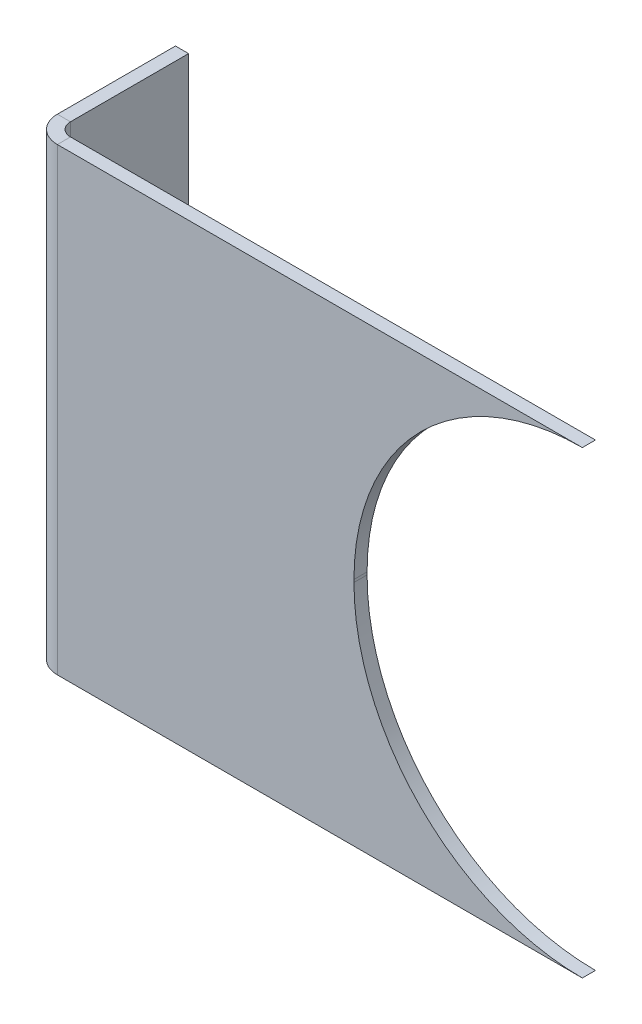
ISO-10303-21;
HEADER;
FILE_DESCRIPTION(('STEP AP214'),'2;1');
FILE_NAME('part.step','',(''),(''),'','','');
FILE_SCHEMA(('AUTOMOTIVE_DESIGN { 1 0 10303 214 1 1 1 1 }'));
ENDSEC;
DATA;
#1=APPLICATION_CONTEXT('core data for automotive mechanical design processes');
#2=APPLICATION_PROTOCOL_DEFINITION('international standard','automotive_design',2000,#1);
#3=PRODUCT_CONTEXT('',#1,'mechanical');
#4=PRODUCT('Part','Part','',(#3));
#5=PRODUCT_RELATED_PRODUCT_CATEGORY('part','',(#4));
#6=PRODUCT_DEFINITION_FORMATION('','',#4);
#7=PRODUCT_DEFINITION_CONTEXT('part definition',#1,'design');
#8=PRODUCT_DEFINITION('design','',#6,#7);
#9=PRODUCT_DEFINITION_SHAPE('','',#8);
#10=(LENGTH_UNIT() NAMED_UNIT(*) SI_UNIT(.MILLI.,.METRE.));
#11=(NAMED_UNIT(*) PLANE_ANGLE_UNIT() SI_UNIT($,.RADIAN.));
#12=(NAMED_UNIT(*) SI_UNIT($,.STERADIAN.) SOLID_ANGLE_UNIT());
#13=UNCERTAINTY_MEASURE_WITH_UNIT(LENGTH_MEASURE(1.E-05),#10,'distance_accuracy_value','');
#14=(GEOMETRIC_REPRESENTATION_CONTEXT(3) GLOBAL_UNCERTAINTY_ASSIGNED_CONTEXT((#13)) GLOBAL_UNIT_ASSIGNED_CONTEXT((#10,
#11,#12)) REPRESENTATION_CONTEXT('',''));
#15=CARTESIAN_POINT('',(0.,0.,0.));
#16=DIRECTION('',(0.,0.,1.));
#17=DIRECTION('',(1.,0.,0.));
#18=AXIS2_PLACEMENT_3D('',#15,#16,#17);
#19=CARTESIAN_POINT('',(-54.6000000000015,-65.0500000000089,1.));
#20=DIRECTION('',(0.,1.,0.));
#21=DIRECTION('',(-1.,0.,0.));
#22=AXIS2_PLACEMENT_3D('',#19,#20,#21);
#23=PLANE('',#22);
#24=DIRECTION('',(0.,0.,1.));
#25=VECTOR('',#24,1.);
#26=CARTESIAN_POINT('',(-94.5999999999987,-65.0500000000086,0.));
#27=LINE('',#26,#25);
#28=CARTESIAN_POINT('',(-94.5999999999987,-65.0500000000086,0.));
#29=VERTEX_POINT('',#28);
#30=CARTESIAN_POINT('',(-94.5999999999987,-65.0500000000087,1.));
#31=VERTEX_POINT('',#30);
#32=EDGE_CURVE('E200',#29,#31,#27,.T.);
#33=ORIENTED_EDGE('',*,*,#32,.F.);
#34=DIRECTION('',(1.,0.,0.));
#35=VECTOR('',#34,1.);
#36=CARTESIAN_POINT('',(-54.6000000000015,-65.0500000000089,0.));
#37=LINE('',#36,#35);
#38=CARTESIAN_POINT('',(-54.6000000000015,-65.0500000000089,0.));
#39=VERTEX_POINT('',#38);
#40=EDGE_CURVE('E202',#29,#39,#37,.T.);
#41=ORIENTED_EDGE('',*,*,#40,.T.);
#42=DIRECTION('',(0.,0.,-1.));
#43=VECTOR('',#42,1.);
#44=CARTESIAN_POINT('',(-54.6000000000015,-65.0500000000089,1.));
#45=LINE('',#44,#43);
#46=CARTESIAN_POINT('',(-54.6000000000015,-65.0500000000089,1.));
#47=VERTEX_POINT('',#46);
#48=EDGE_CURVE('E13',#47,#39,#45,.T.);
#49=ORIENTED_EDGE('',*,*,#48,.F.);
#50=DIRECTION('',(1.,0.,0.));
#51=VECTOR('',#50,1.);
#52=CARTESIAN_POINT('',(-54.6000000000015,-65.0500000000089,1.));
#53=LINE('',#52,#51);
#54=EDGE_CURVE('E108',#31,#47,#53,.T.);
#55=ORIENTED_EDGE('',*,*,#54,.F.);
#56=EDGE_LOOP('',(#33,#41,#49,#55));
#57=FACE_BOUND('',#56,.T.);
#58=ADVANCED_FACE('F57',(#57),#23,.F.);
#59=CARTESIAN_POINT('',(-54.6000000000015,-30.0500000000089,1.));
#60=DIRECTION('',(0.,-1.,0.));
#61=DIRECTION('',(1.,0.,0.));
#62=AXIS2_PLACEMENT_3D('',#59,#60,#61);
#63=PLANE('',#62);
#64=DIRECTION('',(0.,0.,1.));
#65=VECTOR('',#64,1.);
#66=CARTESIAN_POINT('',(-94.5999999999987,-30.0500000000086,0.));
#67=LINE('',#66,#65);
#68=CARTESIAN_POINT('',(-94.5999999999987,-30.0500000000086,0.));
#69=VERTEX_POINT('',#68);
#70=CARTESIAN_POINT('',(-94.5999999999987,-30.0500000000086,0.999999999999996));
#71=VERTEX_POINT('',#70);
#72=EDGE_CURVE('E193',#69,#71,#67,.T.);
#73=ORIENTED_EDGE('',*,*,#72,.T.);
#74=DIRECTION('',(-1.,0.,0.));
#75=VECTOR('',#74,1.);
#76=CARTESIAN_POINT('',(-54.6000000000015,-30.0500000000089,1.));
#77=LINE('',#76,#75);
#78=CARTESIAN_POINT('',(-54.6000000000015,-30.0500000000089,1.));
#79=VERTEX_POINT('',#78);
#80=EDGE_CURVE('E211',#79,#71,#77,.T.);
#81=ORIENTED_EDGE('',*,*,#80,.F.);
#82=DIRECTION('',(0.,0.,-1.));
#83=VECTOR('',#82,1.);
#84=CARTESIAN_POINT('',(-54.6000000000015,-30.0500000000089,1.));
#85=LINE('',#84,#83);
#86=CARTESIAN_POINT('',(-54.6000000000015,-30.0500000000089,0.));
#87=VERTEX_POINT('',#86);
#88=EDGE_CURVE('E213',#79,#87,#85,.T.);
#89=ORIENTED_EDGE('',*,*,#88,.T.);
#90=DIRECTION('',(-1.,0.,0.));
#91=VECTOR('',#90,1.);
#92=CARTESIAN_POINT('',(-54.6000000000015,-30.0500000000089,0.));
#93=LINE('',#92,#91);
#94=EDGE_CURVE('E206',#87,#69,#93,.T.);
#95=ORIENTED_EDGE('',*,*,#94,.T.);
#96=EDGE_LOOP('',(#73,#81,#89,#95));
#97=FACE_BOUND('',#96,.T.);
#98=ADVANCED_FACE('F240',(#97),#63,.F.);
#99=CARTESIAN_POINT('',(-54.6000000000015,-47.6500000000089,1.));
#100=DIRECTION('',(0.,0.,1.));
#101=DIRECTION('',(1.,0.,0.));
#102=AXIS2_PLACEMENT_3D('',#99,#100,#101);
#103=PLANE('',#102);
#104=ORIENTED_EDGE('',*,*,#80,.T.);
#105=DIRECTION('',(0.,1.,0.));
#106=VECTOR('',#105,1.);
#107=CARTESIAN_POINT('',(-94.5999999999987,-30.0500000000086,0.999999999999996));
#108=LINE('',#107,#106);
#109=EDGE_CURVE('E146',#71,#31,#108,.F.);
#110=ORIENTED_EDGE('',*,*,#109,.T.);
#111=ORIENTED_EDGE('',*,*,#54,.T.);
#112=CARTESIAN_POINT('',(-54.6000000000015,-47.6500000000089,1.));
#113=DIRECTION('',(0.,0.,-1.));
#114=DIRECTION('',(1.,0.,0.));
#115=AXIS2_PLACEMENT_3D('',#112,#113,#114);
#116=CIRCLE('',#115,17.4);
#117=CARTESIAN_POINT('',(-72.0000000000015,-47.6500000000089,1.));
#118=VERTEX_POINT('',#117);
#119=EDGE_CURVE('E205',#47,#118,#116,.T.);
#120=ORIENTED_EDGE('',*,*,#119,.T.);
#121=DIRECTION('',(0.,1.,0.));
#122=VECTOR('',#121,1.);
#123=CARTESIAN_POINT('',(-72.0000000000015,-47.4500000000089,1.));
#124=LINE('',#123,#122);
#125=CARTESIAN_POINT('',(-72.0000000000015,-47.4500000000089,1.));
#126=VERTEX_POINT('',#125);
#127=EDGE_CURVE('E208',#118,#126,#124,.T.);
#128=ORIENTED_EDGE('',*,*,#127,.T.);
#129=CARTESIAN_POINT('',(-54.6000000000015,-47.4500000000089,1.));
#130=DIRECTION('',(0.,0.,-1.));
#131=DIRECTION('',(1.,0.,0.));
#132=AXIS2_PLACEMENT_3D('',#129,#130,#131);
#133=CIRCLE('',#132,17.4);
#134=EDGE_CURVE('E80',#126,#79,#133,.T.);
#135=ORIENTED_EDGE('',*,*,#134,.T.);
#136=EDGE_LOOP('',(#104,#110,#111,#120,#128,#135));
#137=FACE_BOUND('',#136,.T.);
#138=ADVANCED_FACE('F260',(#137),#103,.T.);
#139=CARTESIAN_POINT('',(-54.6000000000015,-47.6500000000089,0.));
#140=DIRECTION('',(0.,0.,1.));
#141=DIRECTION('',(1.,0.,0.));
#142=AXIS2_PLACEMENT_3D('',#139,#140,#141);
#143=PLANE('',#142);
#144=DIRECTION('',(0.,1.,0.));
#145=VECTOR('',#144,1.);
#146=CARTESIAN_POINT('',(-94.5999999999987,-30.0500000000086,0.));
#147=LINE('',#146,#145);
#148=EDGE_CURVE('E197',#69,#29,#147,.F.);
#149=ORIENTED_EDGE('',*,*,#148,.F.);
#150=ORIENTED_EDGE('',*,*,#94,.F.);
#151=CARTESIAN_POINT('',(-54.6000000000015,-47.4500000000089,0.));
#152=DIRECTION('',(0.,0.,-1.));
#153=DIRECTION('',(1.,0.,0.));
#154=AXIS2_PLACEMENT_3D('',#151,#152,#153);
#155=CIRCLE('',#154,17.4);
#156=CARTESIAN_POINT('',(-72.0000000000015,-47.4500000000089,0.));
#157=VERTEX_POINT('',#156);
#158=EDGE_CURVE('E101',#157,#87,#155,.T.);
#159=ORIENTED_EDGE('',*,*,#158,.F.);
#160=DIRECTION('',(0.,1.,0.));
#161=VECTOR('',#160,1.);
#162=CARTESIAN_POINT('',(-72.0000000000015,-47.4500000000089,0.));
#163=LINE('',#162,#161);
#164=CARTESIAN_POINT('',(-72.0000000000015,-47.6500000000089,0.));
#165=VERTEX_POINT('',#164);
#166=EDGE_CURVE('E217',#165,#157,#163,.T.);
#167=ORIENTED_EDGE('',*,*,#166,.F.);
#168=CARTESIAN_POINT('',(-54.6000000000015,-47.6500000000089,0.));
#169=DIRECTION('',(0.,0.,-1.));
#170=DIRECTION('',(1.,0.,0.));
#171=AXIS2_PLACEMENT_3D('',#168,#169,#170);
#172=CIRCLE('',#171,17.4);
#173=EDGE_CURVE('E215',#39,#165,#172,.T.);
#174=ORIENTED_EDGE('',*,*,#173,.F.);
#175=ORIENTED_EDGE('',*,*,#40,.F.);
#176=EDGE_LOOP('',(#149,#150,#159,#167,#174,#175));
#177=FACE_BOUND('',#176,.T.);
#178=ADVANCED_FACE('F236',(#177),#143,.F.);
#179=CARTESIAN_POINT('',(-54.6000000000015,-47.6500000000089,1.));
#180=DIRECTION('',(0.,0.,-1.));
#181=DIRECTION('',(-1.,0.,0.));
#182=AXIS2_PLACEMENT_3D('',#179,#180,#181);
#183=CYLINDRICAL_SURFACE('',#182,17.4);
#184=ORIENTED_EDGE('',*,*,#173,.T.);
#185=DIRECTION('',(0.,0.,-1.));
#186=VECTOR('',#185,1.);
#187=CARTESIAN_POINT('',(-72.0000000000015,-47.6500000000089,1.));
#188=LINE('',#187,#186);
#189=EDGE_CURVE('E64',#118,#165,#188,.T.);
#190=ORIENTED_EDGE('',*,*,#189,.F.);
#191=ORIENTED_EDGE('',*,*,#119,.F.);
#192=ORIENTED_EDGE('',*,*,#48,.T.);
#193=EDGE_LOOP('',(#184,#190,#191,#192));
#194=FACE_BOUND('',#193,.T.);
#195=ADVANCED_FACE('F252',(#194),#183,.F.);
#196=CARTESIAN_POINT('',(-72.0000000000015,-47.4500000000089,1.));
#197=DIRECTION('',(-1.,0.,0.));
#198=DIRECTION('',(0.,0.,1.));
#199=AXIS2_PLACEMENT_3D('',#196,#197,#198);
#200=PLANE('',#199);
#201=ORIENTED_EDGE('',*,*,#166,.T.);
#202=DIRECTION('',(0.,0.,-1.));
#203=VECTOR('',#202,1.);
#204=CARTESIAN_POINT('',(-72.0000000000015,-47.4500000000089,1.));
#205=LINE('',#204,#203);
#206=EDGE_CURVE('E223',#126,#157,#205,.T.);
#207=ORIENTED_EDGE('',*,*,#206,.F.);
#208=ORIENTED_EDGE('',*,*,#127,.F.);
#209=ORIENTED_EDGE('',*,*,#189,.T.);
#210=EDGE_LOOP('',(#201,#207,#208,#209));
#211=FACE_BOUND('',#210,.T.);
#212=ADVANCED_FACE('F229',(#211),#200,.F.);
#213=CARTESIAN_POINT('',(-54.6000000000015,-47.4500000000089,1.));
#214=DIRECTION('',(0.,0.,-1.));
#215=DIRECTION('',(-1.,0.,0.));
#216=AXIS2_PLACEMENT_3D('',#213,#214,#215);
#217=CYLINDRICAL_SURFACE('',#216,17.4);
#218=ORIENTED_EDGE('',*,*,#158,.T.);
#219=ORIENTED_EDGE('',*,*,#88,.F.);
#220=ORIENTED_EDGE('',*,*,#134,.F.);
#221=ORIENTED_EDGE('',*,*,#206,.T.);
#222=EDGE_LOOP('',(#218,#219,#220,#221));
#223=FACE_BOUND('',#222,.T.);
#224=ADVANCED_FACE('F242',(#223),#217,.F.);
#225=CARTESIAN_POINT('',(-94.5999999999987,-65.0500000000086,-1.00000000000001));
#226=DIRECTION('',(0.,-1.,0.));
#227=DIRECTION('',(0.,0.,-1.));
#228=AXIS2_PLACEMENT_3D('',#225,#226,#227);
#229=PLANE('',#228);
#230=DIRECTION('',(1.,0.,0.));
#231=VECTOR('',#230,1.);
#232=CARTESIAN_POINT('',(-96.5999999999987,-65.0500000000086,-0.999999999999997));
#233=LINE('',#232,#231);
#234=CARTESIAN_POINT('',(-95.5999999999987,-65.0500000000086,-1.));
#235=VERTEX_POINT('',#234);
#236=CARTESIAN_POINT('',(-96.5999999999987,-65.0500000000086,-0.999999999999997));
#237=VERTEX_POINT('',#236);
#238=EDGE_CURVE('E189',#235,#237,#233,.F.);
#239=ORIENTED_EDGE('',*,*,#238,.F.);
#240=CARTESIAN_POINT('',(-94.5999999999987,-65.0500000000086,-1.00000000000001));
#241=DIRECTION('',(0.,1.,0.));
#242=DIRECTION('',(0.,0.,1.));
#243=AXIS2_PLACEMENT_3D('',#240,#241,#242);
#244=CIRCLE('',#243,1.);
#245=EDGE_CURVE('E149',#29,#235,#244,.F.);
#246=ORIENTED_EDGE('',*,*,#245,.F.);
#247=ORIENTED_EDGE('',*,*,#32,.T.);
#248=CARTESIAN_POINT('',(-94.5999999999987,-65.0500000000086,-1.00000000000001));
#249=DIRECTION('',(0.,1.,0.));
#250=DIRECTION('',(0.,0.,1.));
#251=AXIS2_PLACEMENT_3D('',#248,#249,#250);
#252=CIRCLE('',#251,2.);
#253=EDGE_CURVE('E71',#31,#237,#252,.F.);
#254=ORIENTED_EDGE('',*,*,#253,.T.);
#255=EDGE_LOOP('',(#239,#246,#247,#254));
#256=FACE_BOUND('',#255,.T.);
#257=ADVANCED_FACE('F244',(#256),#229,.T.);
#258=CARTESIAN_POINT('',(-94.5999999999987,-30.0500000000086,-1.00000000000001));
#259=DIRECTION('',(0.,-1.,0.));
#260=DIRECTION('',(0.,0.,-1.));
#261=AXIS2_PLACEMENT_3D('',#258,#259,#260);
#262=PLANE('',#261);
#263=CARTESIAN_POINT('',(-94.5999999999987,-30.0500000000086,-1.00000000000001));
#264=DIRECTION('',(0.,1.,0.));
#265=DIRECTION('',(0.,0.,1.));
#266=AXIS2_PLACEMENT_3D('',#263,#264,#265);
#267=CIRCLE('',#266,1.);
#268=CARTESIAN_POINT('',(-95.5999999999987,-30.0500000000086,-1.));
#269=VERTEX_POINT('',#268);
#270=EDGE_CURVE('E156',#269,#69,#267,.T.);
#271=ORIENTED_EDGE('',*,*,#270,.F.);
#272=DIRECTION('',(1.,0.,0.));
#273=VECTOR('',#272,1.);
#274=CARTESIAN_POINT('',(-95.5999999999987,-30.0500000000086,-1.));
#275=LINE('',#274,#273);
#276=CARTESIAN_POINT('',(-96.5999999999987,-30.0500000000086,-0.999999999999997));
#277=VERTEX_POINT('',#276);
#278=EDGE_CURVE('E153',#269,#277,#275,.F.);
#279=ORIENTED_EDGE('',*,*,#278,.T.);
#280=CARTESIAN_POINT('',(-94.5999999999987,-30.0500000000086,-1.00000000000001));
#281=DIRECTION('',(0.,1.,0.));
#282=DIRECTION('',(0.,0.,1.));
#283=AXIS2_PLACEMENT_3D('',#280,#281,#282);
#284=CIRCLE('',#283,2.);
#285=EDGE_CURVE('E141',#277,#71,#284,.T.);
#286=ORIENTED_EDGE('',*,*,#285,.T.);
#287=ORIENTED_EDGE('',*,*,#72,.F.);
#288=EDGE_LOOP('',(#271,#279,#286,#287));
#289=FACE_BOUND('',#288,.T.);
#290=ADVANCED_FACE('F154',(#289),#262,.F.);
#291=CARTESIAN_POINT('',(-94.5999999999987,-30.0500000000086,-1.00000000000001));
#292=DIRECTION('',(0.,1.,0.));
#293=DIRECTION('',(-1.,0.,0.));
#294=AXIS2_PLACEMENT_3D('',#291,#292,#293);
#295=CYLINDRICAL_SURFACE('',#294,2.);
#296=ORIENTED_EDGE('',*,*,#109,.F.);
#297=ORIENTED_EDGE('',*,*,#285,.F.);
#298=DIRECTION('',(0.,1.,0.));
#299=VECTOR('',#298,1.);
#300=CARTESIAN_POINT('',(-96.5999999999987,0.,-0.999999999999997));
#301=LINE('',#300,#299);
#302=EDGE_CURVE('E145',#237,#277,#301,.T.);
#303=ORIENTED_EDGE('',*,*,#302,.F.);
#304=ORIENTED_EDGE('',*,*,#253,.F.);
#305=EDGE_LOOP('',(#296,#297,#303,#304));
#306=FACE_BOUND('',#305,.T.);
#307=ADVANCED_FACE('F143',(#306),#295,.T.);
#308=CARTESIAN_POINT('',(-94.5999999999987,-30.0500000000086,-1.00000000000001));
#309=DIRECTION('',(0.,1.,0.));
#310=DIRECTION('',(-1.,0.,0.));
#311=AXIS2_PLACEMENT_3D('',#308,#309,#310);
#312=CYLINDRICAL_SURFACE('',#311,1.);
#313=ORIENTED_EDGE('',*,*,#148,.T.);
#314=ORIENTED_EDGE('',*,*,#245,.T.);
#315=DIRECTION('',(0.,-1.,0.));
#316=VECTOR('',#315,1.);
#317=CARTESIAN_POINT('',(-95.5999999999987,-65.0500000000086,-1.));
#318=LINE('',#317,#316);
#319=EDGE_CURVE('E160',#235,#269,#318,.F.);
#320=ORIENTED_EDGE('',*,*,#319,.T.);
#321=ORIENTED_EDGE('',*,*,#270,.T.);
#322=EDGE_LOOP('',(#313,#314,#320,#321));
#323=FACE_BOUND('',#322,.T.);
#324=ADVANCED_FACE('F272',(#323),#312,.F.);
#325=CARTESIAN_POINT('',(-96.5999999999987,-65.0500000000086,-10.));
#326=DIRECTION('',(0.,1.,0.));
#327=DIRECTION('',(0.,0.,1.));
#328=AXIS2_PLACEMENT_3D('',#325,#326,#327);
#329=PLANE('',#328);
#330=ORIENTED_EDGE('',*,*,#238,.T.);
#331=DIRECTION('',(0.,0.,-1.));
#332=VECTOR('',#331,1.);
#333=CARTESIAN_POINT('',(-96.5999999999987,-65.0500000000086,3.15394762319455E-13));
#334=LINE('',#333,#332);
#335=CARTESIAN_POINT('',(-96.5999999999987,-65.0500000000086,-10.));
#336=VERTEX_POINT('',#335);
#337=EDGE_CURVE('E168',#336,#237,#334,.F.);
#338=ORIENTED_EDGE('',*,*,#337,.F.);
#339=DIRECTION('',(1.,0.,0.));
#340=VECTOR('',#339,1.);
#341=CARTESIAN_POINT('',(-96.5999999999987,-65.0500000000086,-10.));
#342=LINE('',#341,#340);
#343=CARTESIAN_POINT('',(-95.5999999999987,-65.0500000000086,-10.));
#344=VERTEX_POINT('',#343);
#345=EDGE_CURVE('E177',#336,#344,#342,.T.);
#346=ORIENTED_EDGE('',*,*,#345,.T.);
#347=DIRECTION('',(0.,0.,1.));
#348=VECTOR('',#347,1.);
#349=CARTESIAN_POINT('',(-95.5999999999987,-65.0500000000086,-10.));
#350=LINE('',#349,#348);
#351=EDGE_CURVE('E169',#344,#235,#350,.T.);
#352=ORIENTED_EDGE('',*,*,#351,.T.);
#353=EDGE_LOOP('',(#330,#338,#346,#352));
#354=FACE_BOUND('',#353,.T.);
#355=ADVANCED_FACE('F275',(#354),#329,.F.);
#356=CARTESIAN_POINT('',(-96.5999999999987,-30.0500000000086,0.));
#357=DIRECTION('',(0.,-1.,0.));
#358=DIRECTION('',(0.,0.,-1.));
#359=AXIS2_PLACEMENT_3D('',#356,#357,#358);
#360=PLANE('',#359);
#361=ORIENTED_EDGE('',*,*,#278,.F.);
#362=DIRECTION('',(0.,0.,-1.));
#363=VECTOR('',#362,1.);
#364=CARTESIAN_POINT('',(-95.5999999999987,-30.0500000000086,0.));
#365=LINE('',#364,#363);
#366=CARTESIAN_POINT('',(-95.5999999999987,-30.0500000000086,-10.));
#367=VERTEX_POINT('',#366);
#368=EDGE_CURVE('E184',#269,#367,#365,.T.);
#369=ORIENTED_EDGE('',*,*,#368,.T.);
#370=DIRECTION('',(1.,0.,0.));
#371=VECTOR('',#370,1.);
#372=CARTESIAN_POINT('',(-96.5999999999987,-30.0500000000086,-10.));
#373=LINE('',#372,#371);
#374=CARTESIAN_POINT('',(-96.5999999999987,-30.0500000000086,-10.));
#375=VERTEX_POINT('',#374);
#376=EDGE_CURVE('E173',#375,#367,#373,.T.);
#377=ORIENTED_EDGE('',*,*,#376,.F.);
#378=DIRECTION('',(0.,0.,1.));
#379=VECTOR('',#378,1.);
#380=CARTESIAN_POINT('',(-96.5999999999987,-30.0500000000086,3.95244083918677E-13));
#381=LINE('',#380,#379);
#382=EDGE_CURVE('E165',#277,#375,#381,.F.);
#383=ORIENTED_EDGE('',*,*,#382,.F.);
#384=EDGE_LOOP('',(#361,#369,#377,#383));
#385=FACE_BOUND('',#384,.T.);
#386=ADVANCED_FACE('F171',(#385),#360,.F.);
#387=CARTESIAN_POINT('',(-96.5999999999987,0.,4.056697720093E-13));
#388=DIRECTION('',(-1.,0.,0.));
#389=DIRECTION('',(0.,0.,1.));
#390=AXIS2_PLACEMENT_3D('',#387,#388,#389);
#391=PLANE('',#390);
#392=ORIENTED_EDGE('',*,*,#337,.T.);
#393=ORIENTED_EDGE('',*,*,#302,.T.);
#394=ORIENTED_EDGE('',*,*,#382,.T.);
#395=DIRECTION('',(0.,1.,0.));
#396=VECTOR('',#395,1.);
#397=CARTESIAN_POINT('',(-96.5999999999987,0.,-10.));
#398=LINE('',#397,#396);
#399=EDGE_CURVE('E175',#375,#336,#398,.F.);
#400=ORIENTED_EDGE('',*,*,#399,.T.);
#401=EDGE_LOOP('',(#392,#393,#394,#400));
#402=FACE_BOUND('',#401,.T.);
#403=ADVANCED_FACE('F164',(#402),#391,.T.);
#404=CARTESIAN_POINT('',(-95.5999999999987,0.,4.02178290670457E-13));
#405=DIRECTION('',(-1.,0.,0.));
#406=DIRECTION('',(0.,0.,1.));
#407=AXIS2_PLACEMENT_3D('',#404,#405,#406);
#408=PLANE('',#407);
#409=ORIENTED_EDGE('',*,*,#319,.F.);
#410=ORIENTED_EDGE('',*,*,#351,.F.);
#411=DIRECTION('',(0.,-1.,0.));
#412=VECTOR('',#411,1.);
#413=CARTESIAN_POINT('',(-95.5999999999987,-30.0500000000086,-10.));
#414=LINE('',#413,#412);
#415=EDGE_CURVE('E179',#367,#344,#414,.T.);
#416=ORIENTED_EDGE('',*,*,#415,.F.);
#417=ORIENTED_EDGE('',*,*,#368,.F.);
#418=EDGE_LOOP('',(#409,#410,#416,#417));
#419=FACE_BOUND('',#418,.T.);
#420=ADVANCED_FACE('F287',(#419),#408,.F.);
#421=CARTESIAN_POINT('',(-96.5999999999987,-30.0500000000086,-10.));
#422=DIRECTION('',(0.,0.,1.));
#423=DIRECTION('',(1.,0.,0.));
#424=AXIS2_PLACEMENT_3D('',#421,#422,#423);
#425=PLANE('',#424);
#426=ORIENTED_EDGE('',*,*,#415,.T.);
#427=ORIENTED_EDGE('',*,*,#345,.F.);
#428=ORIENTED_EDGE('',*,*,#399,.F.);
#429=ORIENTED_EDGE('',*,*,#376,.T.);
#430=EDGE_LOOP('',(#426,#427,#428,#429));
#431=FACE_BOUND('',#430,.T.);
#432=ADVANCED_FACE('F284',(#431),#425,.F.);
#433=CLOSED_SHELL('',(#58,#98,#138,#178,#195,#212,#224,#257,#290,#307,#324,#355,#386,#403,#420,#432));
#434=MANIFOLD_SOLID_BREP('B2',#433);
#435=ADVANCED_BREP_SHAPE_REPRESENTATION('',(#18,#434),#14);
#436=SHAPE_DEFINITION_REPRESENTATION(#9,#435);
ENDSEC;
END-ISO-10303-21;
